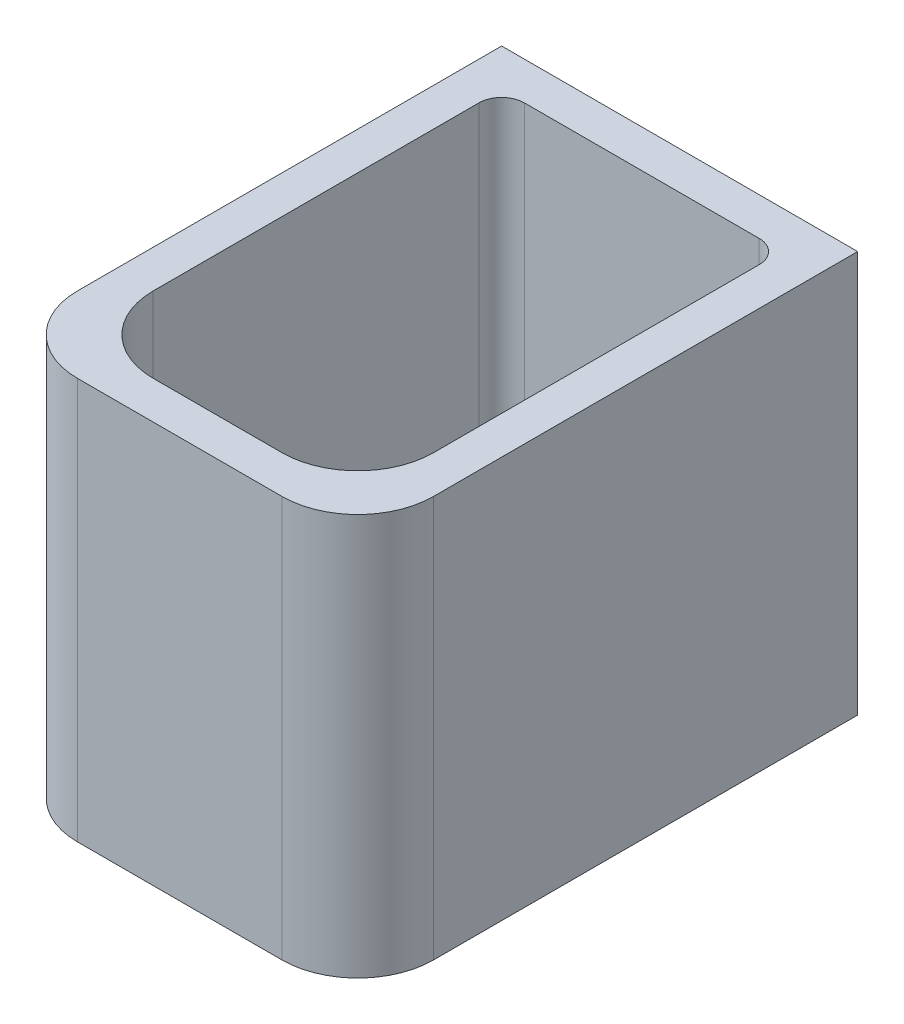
from build123d import *

# Parameters (mm, degrees)
SKETCH_1_W      = 4.7
SKETCH_1_H      = 6.6
EXTRUDE_1_DEPTH = 0.3
SKETCH_2_W      = 4.7
SKETCH_2_H      = 6.6
SKETCH_2_W_2    = 3.7
SKETCH_2_H_2    = 5.6
EXTRUDE_2_DEPTH = 5
FILLET_1_R      = 1
FILLET_2_R      = 0.3


with BuildPart() as part:
    # Sketch 1 → Extrude 1 (new body)
    with BuildSketch(Plane(origin=(0, 0, 0), x_dir=(1, 0, 0), z_dir=(0, 1, 0))):
        Rectangle(SKETCH_1_W, SKETCH_1_H)
    extrude(amount=EXTRUDE_1_DEPTH)

    # Sketch 2 → Extrude 2 (add)
    with BuildSketch(Plane(origin=(0, 0.3, 0), x_dir=(1, 0, 0), z_dir=(0, 1, 0))):
        Rectangle(SKETCH_2_W, SKETCH_2_H)
        Rectangle(SKETCH_2_W_2, SKETCH_2_H_2, mode=Mode.SUBTRACT)
    extrude(amount=EXTRUDE_2_DEPTH)

    # Fillet 1
    fillet_1_edges = [part.edges().sort_by_distance(p)[0] for p in [
        (-1.85, 2.8, 2.8),
        (1.85, 2.8, 2.8),
        (2.35, 2.65, 3.3),
        (-2.35, 2.65, 3.3),
    ]]
    fillet(fillet_1_edges, radius=FILLET_1_R)

    # Fillet 2
    fillet_2_edges = [part.edges().sort_by_distance(p)[0] for p in [
        (1.85, 2.8, -2.8),
        (-1.85, 2.8, -2.8),
    ]]
    fillet(fillet_2_edges, radius=FILLET_2_R)


solid = part.part
